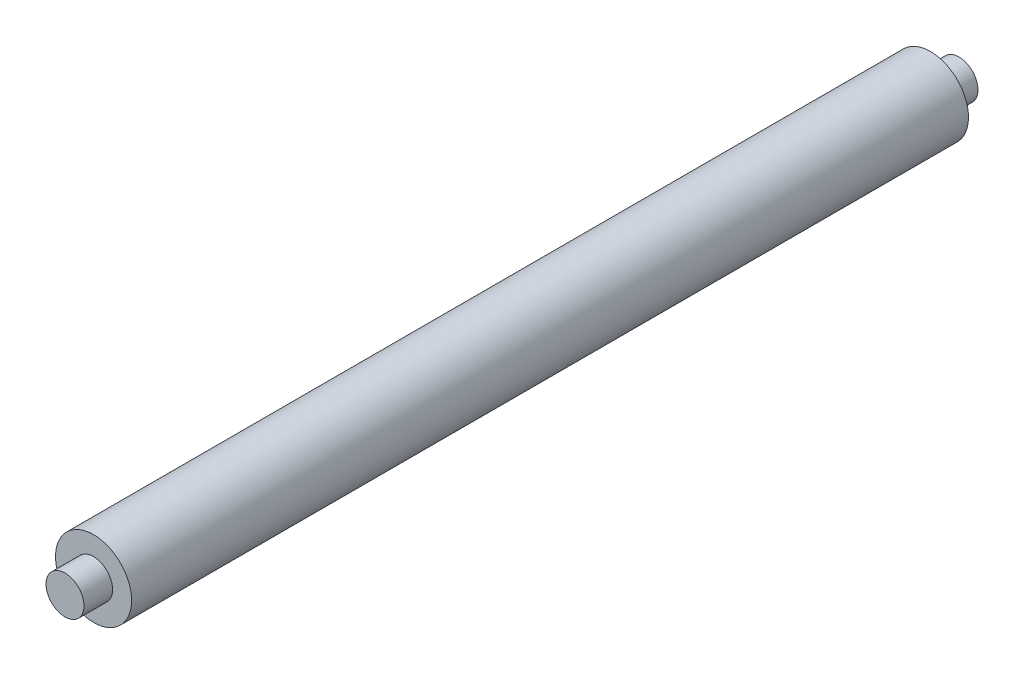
from build123d import *

# Parameters (mm, degrees)
SKETCH1_R           = 25.4
BASE_EXTRUDE_DEPTH  = 279.4
SKETCH2_R           = 12.7
BOSS_EXTRUDE1_DEPTH = 19.05


with BuildPart() as part:
    # Sketch1 → Base-Extrude (new, symmetric)
    with BuildSketch(Plane.XY):
        Circle(SKETCH1_R)
    extrude(amount=BASE_EXTRUDE_DEPTH, both=True)

    # Sketch2 → Boss-Extrude1 (add)
    with BuildSketch(Plane.XY.offset(279.4)):
        with Locations(Location((0, 0, 0), (0, 0, 180))):
            Circle(SKETCH2_R)
    boss_extrude1 = extrude(amount=BOSS_EXTRUDE1_DEPTH)

    # Mirror1: Boss-Extrude1 across plane
    add(boss_extrude1.mirror(Plane.XY))


solid = part.part
